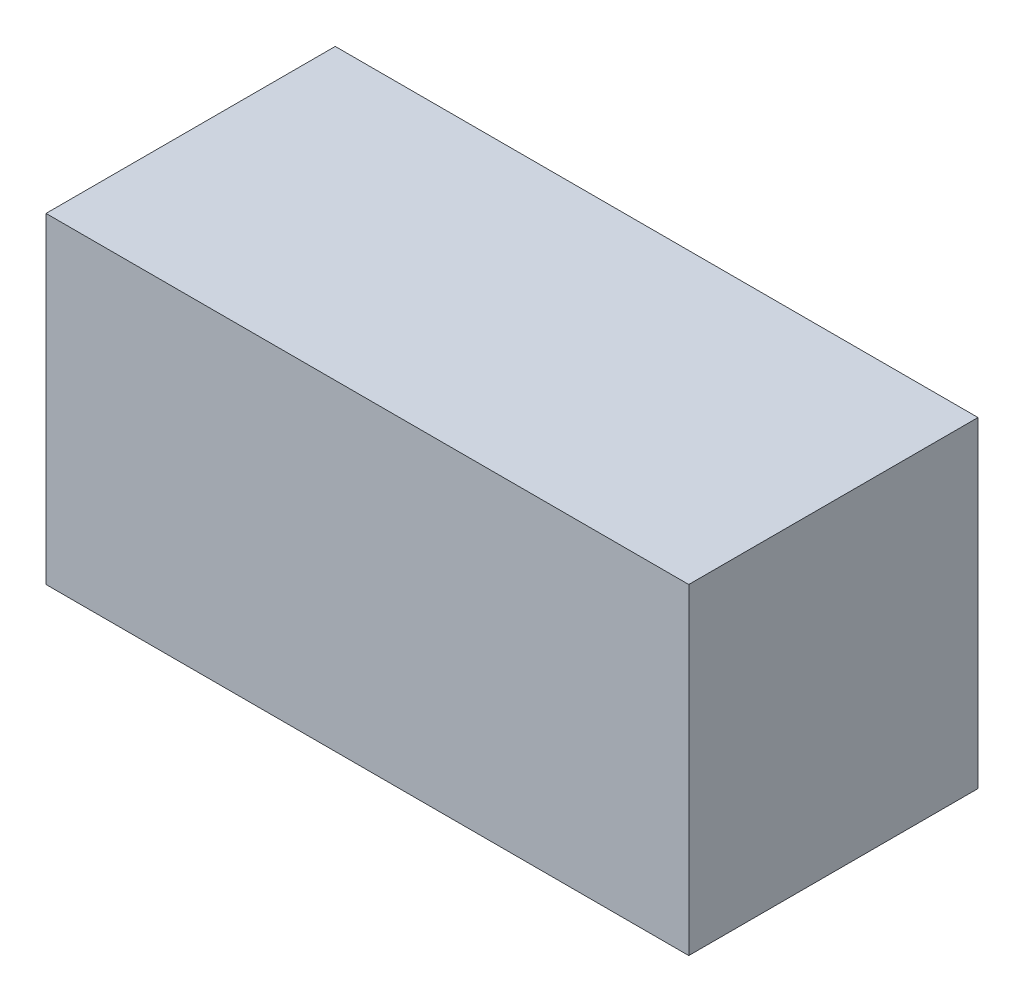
ISO-10303-21;
HEADER;
FILE_DESCRIPTION(('STEP AP214'),'2;1');
FILE_NAME('part.step','',(''),(''),'','','');
FILE_SCHEMA(('AUTOMOTIVE_DESIGN { 1 0 10303 214 1 1 1 1 }'));
ENDSEC;
DATA;
#1=APPLICATION_CONTEXT('core data for automotive mechanical design processes');
#2=APPLICATION_PROTOCOL_DEFINITION('international standard','automotive_design',2000,#1);
#3=PRODUCT_CONTEXT('',#1,'mechanical');
#4=PRODUCT('Part','Part','',(#3));
#5=PRODUCT_RELATED_PRODUCT_CATEGORY('part','',(#4));
#6=PRODUCT_DEFINITION_FORMATION('','',#4);
#7=PRODUCT_DEFINITION_CONTEXT('part definition',#1,'design');
#8=PRODUCT_DEFINITION('design','',#6,#7);
#9=PRODUCT_DEFINITION_SHAPE('','',#8);
#10=(LENGTH_UNIT() NAMED_UNIT(*) SI_UNIT(.MILLI.,.METRE.));
#11=(NAMED_UNIT(*) PLANE_ANGLE_UNIT() SI_UNIT($,.RADIAN.));
#12=(NAMED_UNIT(*) SI_UNIT($,.STERADIAN.) SOLID_ANGLE_UNIT());
#13=UNCERTAINTY_MEASURE_WITH_UNIT(LENGTH_MEASURE(1.E-05),#10,'distance_accuracy_value','');
#14=(GEOMETRIC_REPRESENTATION_CONTEXT(3) GLOBAL_UNCERTAINTY_ASSIGNED_CONTEXT((#13)) GLOBAL_UNIT_ASSIGNED_CONTEXT((#10,
#11,#12)) REPRESENTATION_CONTEXT('',''));
#15=CARTESIAN_POINT('',(0.,0.,0.));
#16=DIRECTION('',(0.,0.,1.));
#17=DIRECTION('',(1.,0.,0.));
#18=AXIS2_PLACEMENT_3D('',#15,#16,#17);
#19=CARTESIAN_POINT('',(-0.499998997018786,-0.249999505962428,0.));
#20=DIRECTION('',(-1.,-1.19248806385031E-08,0.));
#21=DIRECTION('',(-1.19248806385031E-08,1.,0.));
#22=AXIS2_PLACEMENT_3D('',#19,#20,#21);
#23=PLANE('',#22);
#24=DIRECTION('',(0.,0.,1.));
#25=VECTOR('',#24,1.);
#26=CARTESIAN_POINT('',(-0.499998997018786,-0.249999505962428,0.));
#27=LINE('',#26,#25);
#28=CARTESIAN_POINT('',(-0.499998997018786,-0.249999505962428,0.));
#29=VERTEX_POINT('',#28);
#30=CARTESIAN_POINT('',(-0.499998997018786,-0.249999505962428,0.4499991));
#31=VERTEX_POINT('',#30);
#32=EDGE_CURVE('E11',#29,#31,#27,.T.);
#33=ORIENTED_EDGE('',*,*,#32,.T.);
#34=DIRECTION('',(-1.19248806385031E-08,1.,0.));
#35=VECTOR('',#34,1.);
#36=CARTESIAN_POINT('',(-0.499998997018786,-0.249999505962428,0.4499991));
#37=LINE('',#36,#35);
#38=CARTESIAN_POINT('',(-0.499999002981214,0.249999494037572,0.4499991));
#39=VERTEX_POINT('',#38);
#40=EDGE_CURVE('E24',#31,#39,#37,.T.);
#41=ORIENTED_EDGE('',*,*,#40,.T.);
#42=DIRECTION('',(0.,0.,1.));
#43=VECTOR('',#42,1.);
#44=CARTESIAN_POINT('',(-0.499999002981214,0.249999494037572,0.));
#45=LINE('',#44,#43);
#46=CARTESIAN_POINT('',(-0.499999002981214,0.249999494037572,0.));
#47=VERTEX_POINT('',#46);
#48=EDGE_CURVE('E85',#47,#39,#45,.T.);
#49=ORIENTED_EDGE('',*,*,#48,.F.);
#50=DIRECTION('',(-1.19248806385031E-08,1.,0.));
#51=VECTOR('',#50,1.);
#52=CARTESIAN_POINT('',(-0.499998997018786,-0.249999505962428,0.));
#53=LINE('',#52,#51);
#54=EDGE_CURVE('E83',#29,#47,#53,.T.);
#55=ORIENTED_EDGE('',*,*,#54,.F.);
#56=EDGE_LOOP('',(#33,#41,#49,#55));
#57=FACE_BOUND('',#56,.T.);
#58=ADVANCED_FACE('F17',(#57),#23,.T.);
#59=CARTESIAN_POINT('',(-0.499999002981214,0.249999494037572,0.));
#60=DIRECTION('',(-1.19248806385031E-08,1.,0.));
#61=DIRECTION('',(1.,1.19248806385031E-08,0.));
#62=AXIS2_PLACEMENT_3D('',#59,#60,#61);
#63=PLANE('',#62);
#64=ORIENTED_EDGE('',*,*,#48,.T.);
#65=DIRECTION('',(1.,1.19248806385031E-08,0.));
#66=VECTOR('',#65,1.);
#67=CARTESIAN_POINT('',(-0.499999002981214,0.249999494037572,0.4499991));
#68=LINE('',#67,#66);
#69=CARTESIAN_POINT('',(0.499998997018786,0.249999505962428,0.4499991));
#70=VERTEX_POINT('',#69);
#71=EDGE_CURVE('E81',#39,#70,#68,.T.);
#72=ORIENTED_EDGE('',*,*,#71,.T.);
#73=DIRECTION('',(0.,0.,1.));
#74=VECTOR('',#73,1.);
#75=CARTESIAN_POINT('',(0.499998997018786,0.249999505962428,0.));
#76=LINE('',#75,#74);
#77=CARTESIAN_POINT('',(0.499998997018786,0.249999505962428,0.));
#78=VERTEX_POINT('',#77);
#79=EDGE_CURVE('E79',#78,#70,#76,.T.);
#80=ORIENTED_EDGE('',*,*,#79,.F.);
#81=DIRECTION('',(1.,1.19248806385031E-08,0.));
#82=VECTOR('',#81,1.);
#83=CARTESIAN_POINT('',(-0.499999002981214,0.249999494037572,0.));
#84=LINE('',#83,#82);
#85=EDGE_CURVE('E69',#47,#78,#84,.T.);
#86=ORIENTED_EDGE('',*,*,#85,.F.);
#87=EDGE_LOOP('',(#64,#72,#80,#86));
#88=FACE_BOUND('',#87,.T.);
#89=ADVANCED_FACE('F90',(#88),#63,.T.);
#90=CARTESIAN_POINT('',(0.499998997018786,0.249999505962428,0.));
#91=DIRECTION('',(1.,1.19248806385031E-08,0.));
#92=DIRECTION('',(1.19248806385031E-08,-1.,0.));
#93=AXIS2_PLACEMENT_3D('',#90,#91,#92);
#94=PLANE('',#93);
#95=ORIENTED_EDGE('',*,*,#79,.T.);
#96=DIRECTION('',(1.19248806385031E-08,-1.,0.));
#97=VECTOR('',#96,1.);
#98=CARTESIAN_POINT('',(0.499998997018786,0.249999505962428,0.4499991));
#99=LINE('',#98,#97);
#100=CARTESIAN_POINT('',(0.499999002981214,-0.249999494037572,0.4499991));
#101=VERTEX_POINT('',#100);
#102=EDGE_CURVE('E60',#70,#101,#99,.T.);
#103=ORIENTED_EDGE('',*,*,#102,.T.);
#104=DIRECTION('',(0.,0.,1.));
#105=VECTOR('',#104,1.);
#106=CARTESIAN_POINT('',(0.499999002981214,-0.249999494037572,0.));
#107=LINE('',#106,#105);
#108=CARTESIAN_POINT('',(0.499999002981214,-0.249999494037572,0.));
#109=VERTEX_POINT('',#108);
#110=EDGE_CURVE('E54',#109,#101,#107,.T.);
#111=ORIENTED_EDGE('',*,*,#110,.F.);
#112=DIRECTION('',(1.19248806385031E-08,-1.,0.));
#113=VECTOR('',#112,1.);
#114=CARTESIAN_POINT('',(0.499998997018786,0.249999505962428,0.));
#115=LINE('',#114,#113);
#116=EDGE_CURVE('E58',#78,#109,#115,.T.);
#117=ORIENTED_EDGE('',*,*,#116,.F.);
#118=EDGE_LOOP('',(#95,#103,#111,#117));
#119=FACE_BOUND('',#118,.T.);
#120=ADVANCED_FACE('F57',(#119),#94,.T.);
#121=CARTESIAN_POINT('',(0.499999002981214,-0.249999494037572,0.));
#122=DIRECTION('',(1.19248806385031E-08,-1.,0.));
#123=DIRECTION('',(-1.,-1.19248806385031E-08,0.));
#124=AXIS2_PLACEMENT_3D('',#121,#122,#123);
#125=PLANE('',#124);
#126=ORIENTED_EDGE('',*,*,#110,.T.);
#127=DIRECTION('',(-1.,-1.19248806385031E-08,0.));
#128=VECTOR('',#127,1.);
#129=CARTESIAN_POINT('',(0.499999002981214,-0.249999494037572,0.4499991));
#130=LINE('',#129,#128);
#131=EDGE_CURVE('E71',#101,#31,#130,.T.);
#132=ORIENTED_EDGE('',*,*,#131,.T.);
#133=ORIENTED_EDGE('',*,*,#32,.F.);
#134=DIRECTION('',(-1.,-1.19248806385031E-08,0.));
#135=VECTOR('',#134,1.);
#136=CARTESIAN_POINT('',(0.499999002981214,-0.249999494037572,0.));
#137=LINE('',#136,#135);
#138=EDGE_CURVE('E67',#109,#29,#137,.T.);
#139=ORIENTED_EDGE('',*,*,#138,.F.);
#140=EDGE_LOOP('',(#126,#132,#133,#139));
#141=FACE_BOUND('',#140,.T.);
#142=ADVANCED_FACE('F73',(#141),#125,.T.);
#143=CARTESIAN_POINT('',(-0.499998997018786,-0.249999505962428,0.));
#144=DIRECTION('',(0.,0.,1.));
#145=DIRECTION('',(1.19248806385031E-08,-1.,0.));
#146=AXIS2_PLACEMENT_3D('',#143,#144,#145);
#147=PLANE('',#146);
#148=ORIENTED_EDGE('',*,*,#54,.T.);
#149=ORIENTED_EDGE('',*,*,#85,.T.);
#150=ORIENTED_EDGE('',*,*,#116,.T.);
#151=ORIENTED_EDGE('',*,*,#138,.T.);
#152=EDGE_LOOP('',(#148,#149,#150,#151));
#153=FACE_BOUND('',#152,.T.);
#154=ADVANCED_FACE('F66',(#153),#147,.F.);
#155=CARTESIAN_POINT('',(-0.499998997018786,-0.249999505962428,0.4499991));
#156=DIRECTION('',(0.,0.,1.));
#157=DIRECTION('',(1.19248806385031E-08,-1.,0.));
#158=AXIS2_PLACEMENT_3D('',#155,#156,#157);
#159=PLANE('',#158);
#160=ORIENTED_EDGE('',*,*,#131,.F.);
#161=ORIENTED_EDGE('',*,*,#102,.F.);
#162=ORIENTED_EDGE('',*,*,#71,.F.);
#163=ORIENTED_EDGE('',*,*,#40,.F.);
#164=EDGE_LOOP('',(#160,#161,#162,#163));
#165=FACE_BOUND('',#164,.T.);
#166=ADVANCED_FACE('F91',(#165),#159,.T.);
#167=CLOSED_SHELL('',(#58,#89,#120,#142,#154,#166));
#168=MANIFOLD_SOLID_BREP('B1',#167);
#169=ADVANCED_BREP_SHAPE_REPRESENTATION('',(#18,#168),#14);
#170=SHAPE_DEFINITION_REPRESENTATION(#9,#169);
ENDSEC;
END-ISO-10303-21;
